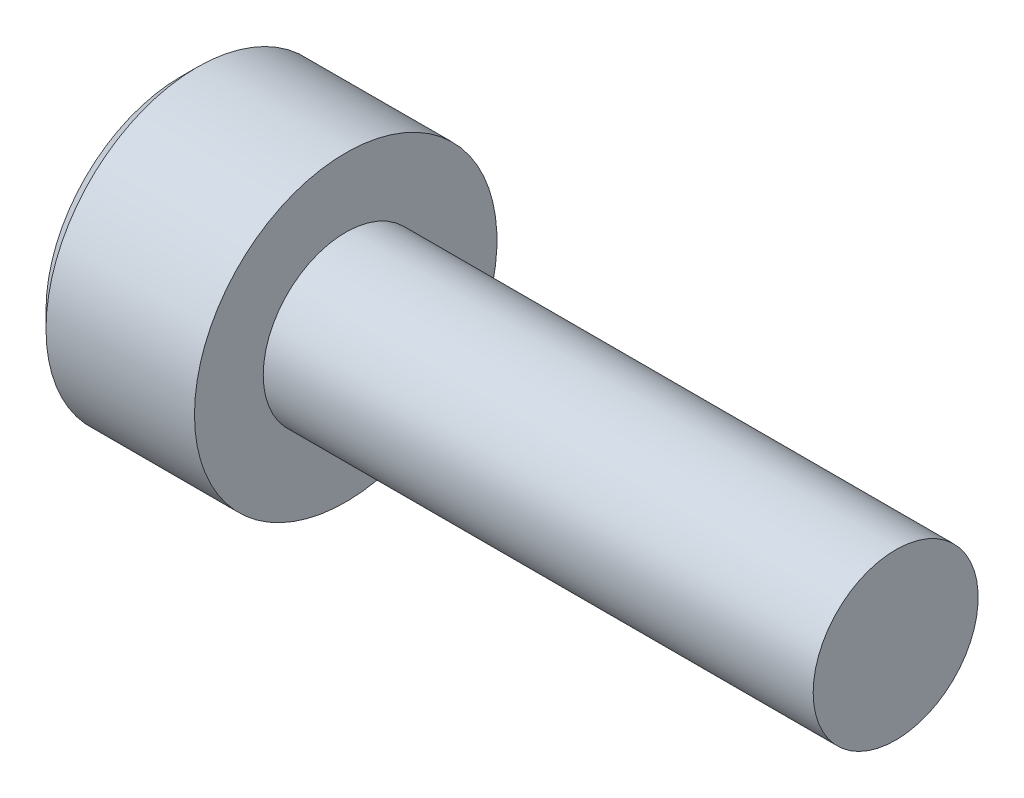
from build123d import *

# Parameters (mm, degrees)
CHAMFER1_SIZE      = 0.3
CUT_EXTRUDE1_DEPTH = 1.3


with BuildPart() as part:
    # Sketch1 → Revolve1 (revolve)
    with BuildSketch(Plane.XY, mode=Mode.PRIVATE) as revolve1_sk:
        Polygon((-3, 0), (10, 0), (10, 1.5), (0, 1.5), (0, 2.75), (-3, 2.75), align=None)
    revolve(revolve1_sk.sketch.rotate(Axis((-3, 0, 0), (1, 0, 0)), 90), axis=Axis((-3, 0, 0), (1, 0, 0)))

    # Chamfer1
    chamfer1_edges = [part.edges().sort_by_distance(p)[0] for p in [
        (-3, 0, -2.75),
    ]]
    chamfer(chamfer1_edges, length=CHAMFER1_SIZE)

    # Sketch2 → Cut-Revolve1 (revolve, cut)
    with BuildSketch(Plane.XY, mode=Mode.PRIVATE) as cut_revolve1_sk:
        Polygon((-0.948924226, 0), (-1.7, 1.25), (-3, 1.25), (-3, 0), align=None)
    revolve(cut_revolve1_sk.sketch.rotate(Axis((-3, 0, 0), (1, 0, 0)), 180), axis=Axis((-3, 0, 0), (1, 0, 0)), mode=Mode.SUBTRACT)

    # Sketch3 → Cut-Extrude1 (cut)
    with BuildSketch(Plane.ZY.offset(3)):
        Polygon((0, -1.443375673), (1.25, -0.721687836), (1.25, 0.721687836), (0, 1.443375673), (-1.25, 0.721687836), (-1.25, -0.721687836), align=None)
    extrude(amount=-CUT_EXTRUDE1_DEPTH, mode=Mode.SUBTRACT)


solid = part.part
